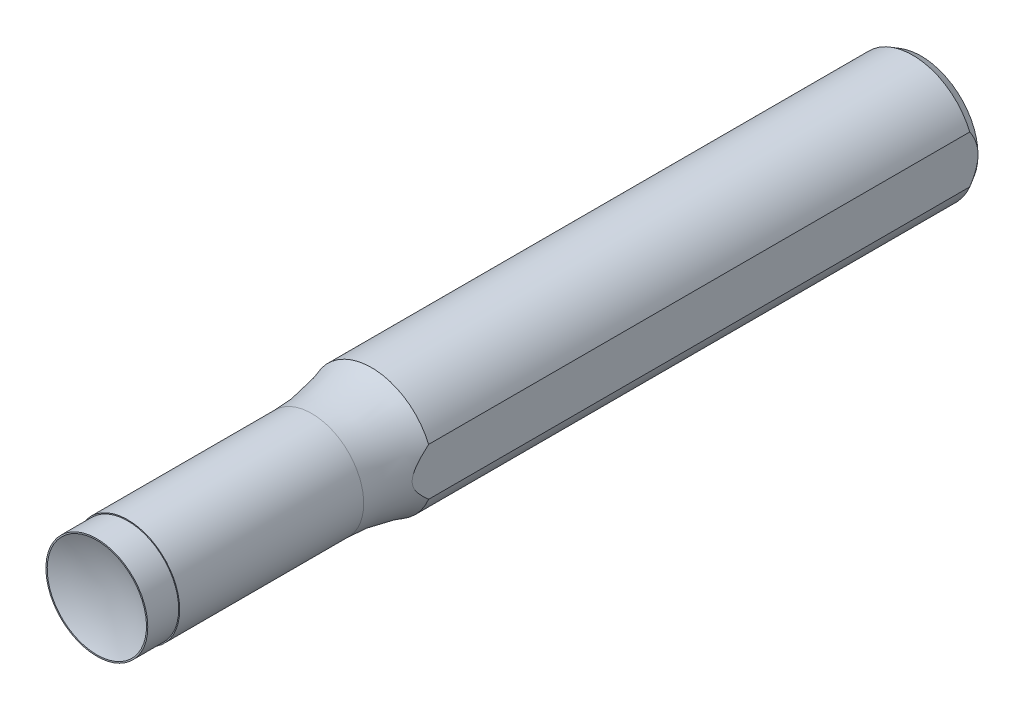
ISO-10303-21;
HEADER;
FILE_DESCRIPTION(('STEP AP214'),'2;1');
FILE_NAME('part.step','',(''),(''),'','','');
FILE_SCHEMA(('AUTOMOTIVE_DESIGN { 1 0 10303 214 1 1 1 1 }'));
ENDSEC;
DATA;
#1=APPLICATION_CONTEXT('core data for automotive mechanical design processes');
#2=APPLICATION_PROTOCOL_DEFINITION('international standard','automotive_design',2000,#1);
#3=PRODUCT_CONTEXT('',#1,'mechanical');
#4=PRODUCT('Part','Part','',(#3));
#5=PRODUCT_RELATED_PRODUCT_CATEGORY('part','',(#4));
#6=PRODUCT_DEFINITION_FORMATION('','',#4);
#7=PRODUCT_DEFINITION_CONTEXT('part definition',#1,'design');
#8=PRODUCT_DEFINITION('design','',#6,#7);
#9=PRODUCT_DEFINITION_SHAPE('','',#8);
#10=(LENGTH_UNIT() NAMED_UNIT(*) SI_UNIT(.MILLI.,.METRE.));
#11=(NAMED_UNIT(*) PLANE_ANGLE_UNIT() SI_UNIT($,.RADIAN.));
#12=(NAMED_UNIT(*) SI_UNIT($,.STERADIAN.) SOLID_ANGLE_UNIT());
#13=UNCERTAINTY_MEASURE_WITH_UNIT(LENGTH_MEASURE(1.E-05),#10,'distance_accuracy_value','');
#14=(GEOMETRIC_REPRESENTATION_CONTEXT(3) GLOBAL_UNCERTAINTY_ASSIGNED_CONTEXT((#13)) GLOBAL_UNIT_ASSIGNED_CONTEXT((#10,
#11,#12)) REPRESENTATION_CONTEXT('',''));
#15=CARTESIAN_POINT('',(0.,0.,0.));
#16=DIRECTION('',(0.,0.,1.));
#17=DIRECTION('',(1.,0.,0.));
#18=AXIS2_PLACEMENT_3D('',#15,#16,#17);
#19=CARTESIAN_POINT('',(0.,0.,-42.3333333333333));
#20=DIRECTION('',(0.,0.,1.));
#21=DIRECTION('',(1.,0.,0.));
#22=AXIS2_PLACEMENT_3D('',#19,#20,#21);
#23=CYLINDRICAL_SURFACE('',#22,8.);
#24=CARTESIAN_POINT('',(0.,0.,-33.123114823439));
#25=DIRECTION('',(0.,0.,1.));
#26=DIRECTION('',(0.,-1.,0.));
#27=AXIS2_PLACEMENT_3D('',#24,#25,#26);
#28=CIRCLE('',#27,8.);
#29=CARTESIAN_POINT('',(0.,-8.,-33.123114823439));
#30=VERTEX_POINT('',#29);
#31=EDGE_CURVE('E79',#30,#30,#28,.F.);
#32=ORIENTED_EDGE('',*,*,#31,.F.);
#33=EDGE_LOOP('',(#32));
#34=FACE_BOUND('',#33,.T.);
#35=CARTESIAN_POINT('',(0.,0.,-4.7625));
#36=DIRECTION('',(0.,0.,1.));
#37=DIRECTION('',(1.,0.,0.));
#38=AXIS2_PLACEMENT_3D('',#35,#36,#37);
#39=CIRCLE('',#38,8.);
#40=CARTESIAN_POINT('',(8.,0.,-4.7625));
#41=VERTEX_POINT('',#40);
#42=EDGE_CURVE('E90',#41,#41,#39,.F.);
#43=ORIENTED_EDGE('',*,*,#42,.T.);
#44=EDGE_LOOP('',(#43));
#45=FACE_BOUND('',#44,.T.);
#46=ADVANCED_FACE('F42',(#34,#45),#23,.T.);
#47=CARTESIAN_POINT('',(0.,0.,-4.7625));
#48=DIRECTION('',(0.,0.,1.));
#49=DIRECTION('',(1.,0.,0.));
#50=AXIS2_PLACEMENT_3D('',#47,#48,#49);
#51=PLANE('',#50);
#52=ORIENTED_EDGE('',*,*,#42,.F.);
#53=EDGE_LOOP('',(#52));
#54=FACE_BOUND('',#53,.T.);
#55=CARTESIAN_POINT('',(0.,0.,-4.7625));
#56=DIRECTION('',(0.,0.,1.));
#57=DIRECTION('',(1.,0.,0.));
#58=AXIS2_PLACEMENT_3D('',#55,#56,#57);
#59=CIRCLE('',#58,7.85);
#60=CARTESIAN_POINT('',(7.85,0.,-4.7625));
#61=VERTEX_POINT('',#60);
#62=EDGE_CURVE('E97',#61,#61,#59,.T.);
#63=ORIENTED_EDGE('',*,*,#62,.F.);
#64=EDGE_LOOP('',(#63));
#65=FACE_BOUND('',#64,.T.);
#66=ADVANCED_FACE('F110',(#54,#65),#51,.T.);
#67=CARTESIAN_POINT('',(0.,0.,-4.7625));
#68=DIRECTION('',(0.,0.,1.));
#69=DIRECTION('',(1.,0.,0.));
#70=AXIS2_PLACEMENT_3D('',#67,#68,#69);
#71=CYLINDRICAL_SURFACE('',#70,7.85);
#72=CARTESIAN_POINT('',(0.,0.,0.));
#73=DIRECTION('',(0.,0.,1.));
#74=DIRECTION('',(1.,0.,0.));
#75=AXIS2_PLACEMENT_3D('',#72,#73,#74);
#76=CIRCLE('',#75,7.85);
#77=CARTESIAN_POINT('',(7.85,0.,0.));
#78=VERTEX_POINT('',#77);
#79=EDGE_CURVE('E122',#78,#78,#76,.T.);
#80=CARTESIAN_POINT('',(7.85,0.,-4.7625));
#81=CARTESIAN_POINT('',(7.85,0.,-4.712890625));
#82=CARTESIAN_POINT('',(7.85,0.,-4.66328125));
#83=CARTESIAN_POINT('',(7.85,0.,-4.5640625));
#84=CARTESIAN_POINT('',(7.85,0.,-4.514453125));
#85=CARTESIAN_POINT('',(7.85,0.,-4.415234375));
#86=CARTESIAN_POINT('',(7.85,0.,-4.365625));
#87=CARTESIAN_POINT('',(7.85,0.,-4.26640625));
#88=CARTESIAN_POINT('',(7.85,0.,-4.216796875));
#89=CARTESIAN_POINT('',(7.85,0.,-4.117578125));
#90=CARTESIAN_POINT('',(7.85,0.,-4.06796875));
#91=CARTESIAN_POINT('',(7.85,0.,-3.96875));
#92=CARTESIAN_POINT('',(7.85,0.,-3.919140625));
#93=CARTESIAN_POINT('',(7.85,0.,-3.819921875));
#94=CARTESIAN_POINT('',(7.85,0.,-3.7703125));
#95=CARTESIAN_POINT('',(7.85,0.,-3.67109375));
#96=CARTESIAN_POINT('',(7.85,0.,-3.621484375));
#97=CARTESIAN_POINT('',(7.85,0.,-3.522265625));
#98=CARTESIAN_POINT('',(7.85,0.,-3.47265625));
#99=CARTESIAN_POINT('',(7.85,0.,-3.3734375));
#100=CARTESIAN_POINT('',(7.85,0.,-3.323828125));
#101=CARTESIAN_POINT('',(7.85,0.,-3.224609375));
#102=CARTESIAN_POINT('',(7.85,0.,-3.175));
#103=CARTESIAN_POINT('',(7.85,0.,-3.07578125));
#104=CARTESIAN_POINT('',(7.85,0.,-3.026171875));
#105=CARTESIAN_POINT('',(7.85,0.,-2.926953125));
#106=CARTESIAN_POINT('',(7.85,0.,-2.87734375));
#107=CARTESIAN_POINT('',(7.85,0.,-2.778125));
#108=CARTESIAN_POINT('',(7.85,0.,-2.728515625));
#109=CARTESIAN_POINT('',(7.85,0.,-2.629296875));
#110=CARTESIAN_POINT('',(7.85,0.,-2.5796875));
#111=CARTESIAN_POINT('',(7.85,0.,-2.48046875));
#112=CARTESIAN_POINT('',(7.85,0.,-2.430859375));
#113=CARTESIAN_POINT('',(7.85,0.,-2.331640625));
#114=CARTESIAN_POINT('',(7.85,0.,-2.28203125));
#115=CARTESIAN_POINT('',(7.85,0.,-2.1828125));
#116=CARTESIAN_POINT('',(7.85,0.,-2.133203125));
#117=CARTESIAN_POINT('',(7.85,0.,-2.033984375));
#118=CARTESIAN_POINT('',(7.85,0.,-1.984375));
#119=CARTESIAN_POINT('',(7.85,0.,-1.88515625));
#120=CARTESIAN_POINT('',(7.85,0.,-1.835546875));
#121=CARTESIAN_POINT('',(7.85,0.,-1.736328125));
#122=CARTESIAN_POINT('',(7.85,0.,-1.68671875));
#123=CARTESIAN_POINT('',(7.85,0.,-1.5875));
#124=CARTESIAN_POINT('',(7.85,0.,-1.537890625));
#125=CARTESIAN_POINT('',(7.85,0.,-1.438671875));
#126=CARTESIAN_POINT('',(7.85,0.,-1.3890625));
#127=CARTESIAN_POINT('',(7.85,0.,-1.28984375));
#128=CARTESIAN_POINT('',(7.85,0.,-1.240234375));
#129=CARTESIAN_POINT('',(7.85,0.,-1.141015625));
#130=CARTESIAN_POINT('',(7.85,0.,-1.09140625));
#131=CARTESIAN_POINT('',(7.85,0.,-0.9921875));
#132=CARTESIAN_POINT('',(7.85,0.,-0.942578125));
#133=CARTESIAN_POINT('',(7.85,0.,-0.843359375));
#134=CARTESIAN_POINT('',(7.85,0.,-0.79375));
#135=CARTESIAN_POINT('',(7.85,0.,-0.69453125));
#136=CARTESIAN_POINT('',(7.85,0.,-0.644921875));
#137=CARTESIAN_POINT('',(7.85,0.,-0.545703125));
#138=CARTESIAN_POINT('',(7.85,0.,-0.49609375));
#139=CARTESIAN_POINT('',(7.85,0.,-0.396875));
#140=CARTESIAN_POINT('',(7.85,0.,-0.347265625));
#141=CARTESIAN_POINT('',(7.85,0.,-0.248046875));
#142=CARTESIAN_POINT('',(7.85,0.,-0.1984375));
#143=CARTESIAN_POINT('',(7.85,0.,-0.09921875));
#144=CARTESIAN_POINT('',(7.85,0.,-0.049609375));
#145=CARTESIAN_POINT('',(7.85,0.,0.));
#146=B_SPLINE_CURVE_WITH_KNOTS('',3,(#80,#81,#82,#83,#84,#85,#86,#87,#88,#89,#90,#91,#92,#93,
#94,#95,#96,#97,#98,#99,#100,#101,#102,#103,#104,#105,#106,#107,#108,#109,#110,#111,#112,#113,
#114,#115,#116,#117,#118,#119,#120,#121,#122,#123,#124,#125,#126,#127,#128,#129,#130,#131,#132,
#133,#134,#135,#136,#137,#138,#139,#140,#141,#142,#143,#144,#145),.UNSPECIFIED.,.F.,.F.,(4,2,2,
2,2,2,2,2,2,2,2,2,2,2,2,2,2,2,2,2,2,2,2,2,2,2,2,2,2,2,2,2,4),(0.,0.148828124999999,
0.297656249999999,0.446484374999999,0.595312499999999,0.744140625,0.89296875,1.041796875,
1.190625,1.339453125,1.48828125,1.637109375,1.7859375,1.934765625,2.08359375,2.232421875,
2.38125,2.530078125,2.67890625,2.827734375,2.9765625,3.125390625,3.27421875,3.423046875,
3.571875,3.720703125,3.86953125,4.018359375,4.1671875,4.316015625,4.46484375,4.613671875,
4.7625),.UNSPECIFIED.);
#147=EDGE_CURVE('BSEAM116',#61,#78,#146,.T.);
#148=ORIENTED_EDGE('',*,*,#62,.T.);
#149=ORIENTED_EDGE('',*,*,#79,.F.);
#150=ORIENTED_EDGE('',*,*,#147,.T.);
#151=ORIENTED_EDGE('',*,*,#147,.F.);
#152=EDGE_LOOP('',(#148,#150,#149,#151));
#153=FACE_BOUND('',#152,.T.);
#154=ADVANCED_FACE('F116',(#153),#71,.T.);
#155=CARTESIAN_POINT('',(0.,0.,0.));
#156=DIRECTION('',(0.,0.,1.));
#157=DIRECTION('',(1.,0.,0.));
#158=AXIS2_PLACEMENT_3D('',#155,#156,#157);
#159=PLANE('',#158);
#160=CARTESIAN_POINT('',(0.,0.,0.));
#161=DIRECTION('',(0.,0.,1.));
#162=DIRECTION('',(0.,-1.,0.));
#163=AXIS2_PLACEMENT_3D('',#160,#161,#162);
#164=CIRCLE('',#163,7.65);
#165=CARTESIAN_POINT('',(0.,-7.65,0.));
#166=VERTEX_POINT('',#165);
#167=EDGE_CURVE('E126',#166,#166,#164,.T.);
#168=ORIENTED_EDGE('',*,*,#167,.F.);
#169=EDGE_LOOP('',(#168));
#170=FACE_BOUND('',#169,.T.);
#171=ORIENTED_EDGE('',*,*,#79,.T.);
#172=EDGE_LOOP('',(#171));
#173=FACE_BOUND('',#172,.T.);
#174=ADVANCED_FACE('F157',(#170,#173),#159,.T.);
#175=CARTESIAN_POINT('',(0.,0.,17.4464896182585));
#176=DIRECTION('',(0.,0.,1.));
#177=DIRECTION('',(0.,-1.,0.));
#178=AXIS2_PLACEMENT_3D('',#175,#176,#177);
#179=SPHERICAL_SURFACE('',#178,19.05);
#180=ORIENTED_EDGE('',*,*,#167,.T.);
#181=EDGE_LOOP('',(#180));
#182=FACE_BOUND('',#181,.T.);
#183=ADVANCED_FACE('F160',(#182),#179,.F.);
#184=CARTESIAN_POINT('',(0.,0.,-33.123114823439));
#185=DIRECTION('',(0.,0.,-1.));
#186=DIRECTION('',(0.,1.,0.));
#187=AXIS2_PLACEMENT_3D('',#184,#185,#186);
#188=TOROIDAL_SURFACE('',#187,36.575,28.575);
#189=CARTESIAN_POINT('',(8.79176515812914,14.7553078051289,-54.1042634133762));
#190=CARTESIAN_POINT('',(8.79176515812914,14.4706916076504,-53.8782049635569));
#191=CARTESIAN_POINT('',(8.79176515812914,14.1891182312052,-53.6483331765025));
#192=CARTESIAN_POINT('',(8.79176515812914,13.6320212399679,-53.181411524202));
#193=CARTESIAN_POINT('',(8.79176515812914,13.3564971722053,-52.944362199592));
#194=CARTESIAN_POINT('',(8.79176515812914,12.8115776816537,-52.4636389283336));
#195=CARTESIAN_POINT('',(8.79176515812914,12.5421788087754,-52.2199688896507));
#196=CARTESIAN_POINT('',(8.79176515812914,12.0092235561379,-51.7263230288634));
#197=CARTESIAN_POINT('',(8.79176515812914,11.7456672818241,-51.4763470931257));
#198=CARTESIAN_POINT('',(8.79176515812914,10.9673966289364,-50.7214050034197));
#199=CARTESIAN_POINT('',(8.79176515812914,10.4610143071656,-50.2078187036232));
#200=CARTESIAN_POINT('',(8.79176515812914,9.46861052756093,-49.161468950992));
#201=CARTESIAN_POINT('',(8.79176515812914,8.9825887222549,-48.6287058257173));
#202=CARTESIAN_POINT('',(8.79176515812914,8.26487396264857,-47.8170319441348));
#203=CARTESIAN_POINT('',(8.79176515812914,8.02689744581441,-47.5436335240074));
#204=CARTESIAN_POINT('',(8.79176515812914,7.55452558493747,-46.9937588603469));
#205=CARTESIAN_POINT('',(8.79176515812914,7.32013024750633,-46.7172826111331));
#206=CARTESIAN_POINT('',(8.79176515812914,6.85396996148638,-46.1618393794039));
#207=CARTESIAN_POINT('',(8.79176515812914,6.6222067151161,-45.8828709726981));
#208=CARTESIAN_POINT('',(8.79176515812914,6.16039479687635,-45.3235479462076));
#209=CARTESIAN_POINT('',(8.79176515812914,5.93034603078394,-45.0431934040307));
#210=CARTESIAN_POINT('',(8.79176515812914,5.47095483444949,-44.4828423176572));
#211=CARTESIAN_POINT('',(8.79176515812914,5.24161191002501,-44.2028461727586));
#212=CARTESIAN_POINT('',(8.79176515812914,4.78110760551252,-43.644227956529));
#213=CARTESIAN_POINT('',(8.79176515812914,4.54994581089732,-43.3656062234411));
#214=CARTESIAN_POINT('',(8.79176515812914,4.19973860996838,-42.950885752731));
#215=CARTESIAN_POINT('',(8.79176515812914,4.08249974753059,-42.8132658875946));
#216=CARTESIAN_POINT('',(8.79176515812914,3.84628047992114,-42.5395315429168));
#217=CARTESIAN_POINT('',(8.79176515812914,3.72730013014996,-42.4034170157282));
#218=CARTESIAN_POINT('',(8.79176515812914,3.48697683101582,-42.1333813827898));
#219=CARTESIAN_POINT('',(8.79176515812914,3.36563484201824,-41.9994594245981));
#220=CARTESIAN_POINT('',(8.79176515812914,3.11968317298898,-41.7346576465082));
#221=CARTESIAN_POINT('',(8.79176515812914,2.99507394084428,-41.6037774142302));
#222=CARTESIAN_POINT('',(8.79176515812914,2.82873759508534,-41.4349837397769));
#223=CARTESIAN_POINT('',(8.79176515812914,2.78900888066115,-41.39509815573));
#224=CARTESIAN_POINT('',(8.79176515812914,2.70907299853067,-41.3158039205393));
#225=CARTESIAN_POINT('',(8.79176515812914,2.66886579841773,-41.2763953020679));
#226=CARTESIAN_POINT('',(8.79176515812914,2.54746475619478,-41.1589751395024));
#227=CARTESIAN_POINT('',(8.79176515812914,2.46548913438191,-41.0817669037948));
#228=CARTESIAN_POINT('',(8.79176515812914,2.2986781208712,-40.9297574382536));
#229=CARTESIAN_POINT('',(8.79176515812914,2.21383197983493,-40.8549679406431));
#230=CARTESIAN_POINT('',(8.79176515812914,2.04111599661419,-40.7089499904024));
#231=CARTESIAN_POINT('',(8.79176515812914,1.9532460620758,-40.6377216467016));
#232=CARTESIAN_POINT('',(8.79176515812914,1.77252194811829,-40.4988724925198));
#233=CARTESIAN_POINT('',(8.79176515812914,1.67961271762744,-40.4313219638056));
#234=CARTESIAN_POINT('',(8.79176515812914,1.48949418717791,-40.3026306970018));
#235=CARTESIAN_POINT('',(8.79176515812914,1.39228331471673,-40.2414923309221));
#236=CARTESIAN_POINT('',(8.79176515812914,1.09437660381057,-40.0716297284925));
#237=CARTESIAN_POINT('',(8.79176515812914,0.88583647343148,-39.9751625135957));
#238=CARTESIAN_POINT('',(8.79176515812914,0.546880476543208,-39.8701156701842));
#239=CARTESIAN_POINT('',(8.79176515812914,0.422763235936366,-39.8415338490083));
#240=CARTESIAN_POINT('',(8.79176515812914,0.171362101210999,-39.8063751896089));
#241=CARTESIAN_POINT('',(8.79176515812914,0.0440802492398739,-39.7997845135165));
#242=CARTESIAN_POINT('',(8.79176515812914,-0.209572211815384,-39.8096967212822));
#243=CARTESIAN_POINT('',(8.79176515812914,-0.335942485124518,-39.8262077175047));
#244=CARTESIAN_POINT('',(8.79176515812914,-0.584210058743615,-39.8797087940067));
#245=CARTESIAN_POINT('',(8.79176515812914,-0.706103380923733,-39.9167166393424));
#246=CARTESIAN_POINT('',(8.79176515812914,-0.919554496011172,-39.9975926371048));
#247=CARTESIAN_POINT('',(8.79176515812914,-1.01225713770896,-40.0385543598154));
#248=CARTESIAN_POINT('',(8.79176515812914,-1.1937288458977,-40.1284994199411));
#249=CARTESIAN_POINT('',(8.79176515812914,-1.28249496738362,-40.177488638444));
#250=CARTESIAN_POINT('',(8.79176515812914,-1.45667079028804,-40.2818858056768));
#251=CARTESIAN_POINT('',(8.79176515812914,-1.54206334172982,-40.3373220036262));
#252=CARTESIAN_POINT('',(8.79176515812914,-1.70945249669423,-40.4529924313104));
#253=CARTESIAN_POINT('',(8.79176515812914,-1.79145043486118,-40.5132247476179));
#254=CARTESIAN_POINT('',(8.79176515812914,-2.02589230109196,-40.6939314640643));
#255=CARTESIAN_POINT('',(8.79176515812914,-2.17452229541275,-40.819336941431));
#256=CARTESIAN_POINT('',(8.79176515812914,-2.46411558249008,-41.07876714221));
#257=CARTESIAN_POINT('',(8.79176515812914,-2.60507190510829,-41.2127994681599));
#258=CARTESIAN_POINT('',(8.79176515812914,-2.88168459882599,-41.4868745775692));
#259=CARTESIAN_POINT('',(8.79176515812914,-3.01732667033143,-41.6269316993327));
#260=CARTESIAN_POINT('',(8.79176515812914,-3.28451490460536,-41.9109062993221));
#261=CARTESIAN_POINT('',(8.79176515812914,-3.41606049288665,-42.0548243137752));
#262=CARTESIAN_POINT('',(8.79176515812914,-3.67734130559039,-42.346572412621));
#263=CARTESIAN_POINT('',(8.79176515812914,-3.80705042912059,-42.4944257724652));
#264=CARTESIAN_POINT('',(8.79176515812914,-4.06436323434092,-42.7919662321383));
#265=CARTESIAN_POINT('',(8.79176515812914,-4.19196675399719,-42.9416534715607));
#266=CARTESIAN_POINT('',(8.79176515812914,-4.44554049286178,-43.241997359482));
#267=CARTESIAN_POINT('',(8.79176515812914,-4.5715129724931,-43.3926521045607));
#268=CARTESIAN_POINT('',(8.79176515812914,-4.82255527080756,-43.6947041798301));
#269=CARTESIAN_POINT('',(8.79176515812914,-4.94762511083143,-43.8461014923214));
#270=CARTESIAN_POINT('',(8.79176515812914,-5.25936331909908,-44.2246586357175));
#271=CARTESIAN_POINT('',(8.79176515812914,-5.44573875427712,-44.4520592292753));
#272=CARTESIAN_POINT('',(8.79176515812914,-5.8185335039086,-44.9068250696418));
#273=CARTESIAN_POINT('',(8.79176515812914,-6.00495281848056,-45.1341903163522));
#274=CARTESIAN_POINT('',(8.79176515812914,-6.37865861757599,-45.5882114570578));
#275=CARTESIAN_POINT('',(8.79176515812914,-6.56594510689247,-45.8148673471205));
#276=CARTESIAN_POINT('',(8.79176515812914,-6.94201956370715,-46.266929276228));
#277=CARTESIAN_POINT('',(8.79176515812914,-7.13080752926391,-46.4923353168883));
#278=CARTESIAN_POINT('',(8.79176515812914,-7.7001630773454,-47.1659316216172));
#279=CARTESIAN_POINT('',(8.79176515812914,-8.08377568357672,-47.6115655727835));
#280=CARTESIAN_POINT('',(8.79176515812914,-8.86211750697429,-48.4930705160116));
#281=CARTESIAN_POINT('',(8.79176515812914,-9.2568469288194,-48.9289413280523));
#282=CARTESIAN_POINT('',(8.79176515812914,-10.0538194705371,-49.782529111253));
#283=CARTESIAN_POINT('',(8.79176515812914,-10.455882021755,-50.2004141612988));
#284=CARTESIAN_POINT('',(8.79176515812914,-11.2739868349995,-51.022231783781));
#285=CARTESIAN_POINT('',(8.79176515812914,-11.6900279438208,-51.426165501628));
#286=CARTESIAN_POINT('',(8.79176515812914,-12.5384978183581,-52.2196285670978));
#287=CARTESIAN_POINT('',(8.79176515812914,-12.9709804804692,-52.6091004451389));
#288=CARTESIAN_POINT('',(8.79176515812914,-13.8514494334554,-53.3704068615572));
#289=CARTESIAN_POINT('',(8.79176515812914,-14.2994410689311,-53.7422352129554));
#290=CARTESIAN_POINT('',(8.79176515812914,-14.7553078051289,-54.1042634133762));
#291=B_SPLINE_CURVE_WITH_KNOTS('',3,(#189,#190,#191,#192,#193,#194,#195,#196,#197,#198,#199,
#200,#201,#202,#203,#204,#205,#206,#207,#208,#209,#210,#211,#212,#213,#214,#215,#216,#217,#218,
#219,#220,#221,#222,#223,#224,#225,#226,#227,#228,#229,#230,#231,#232,#233,#234,#235,#236,#237,
#238,#239,#240,#241,#242,#243,#244,#245,#246,#247,#248,#249,#250,#251,#252,#253,#254,#255,#256,
#257,#258,#259,#260,#261,#262,#263,#264,#265,#266,#267,#268,#269,#270,#271,#272,#273,#274,#275,
#276,#277,#278,#279,#280,#281,#282,#283,#284,#285,#286,#287,#288,#289,#290),.UNSPECIFIED.,.F.,
.F.,(4,2,2,2,2,2,2,2,2,2,2,2,2,2,2,2,2,2,2,2,2,2,2,2,2,2,2,2,2,2,2,2,2,2,2,2,2,2,2,2,2,2,2,2,2,
2,2,2,2,2,4),(0.,1.09035417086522,2.18062641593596,3.2702685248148,4.35993028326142,
6.52296539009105,8.68596356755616,9.77332692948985,10.8606922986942,11.9487248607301,
13.0366971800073,14.1225023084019,15.2085625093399,15.7509156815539,16.2932516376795,
16.8353714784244,17.3774173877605,17.5463017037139,17.7151975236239,18.0529791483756,
18.392208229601,18.7314476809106,19.0757841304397,19.4202475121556,20.1031124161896,
20.4835842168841,20.8638165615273,21.2441824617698,21.6248785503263,21.9284895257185,
22.2323239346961,22.5375437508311,22.8426424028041,23.4254477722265,24.0087739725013,
24.5935748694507,25.1784574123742,25.768484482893,26.3585567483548,26.9476974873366,
27.5368242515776,28.4188786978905,29.3009355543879,30.1829972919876,31.0650578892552,
32.8289256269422,34.592825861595,36.3322209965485,38.0714729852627,39.8170243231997,
41.5631833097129),.UNSPECIFIED.);
#292=CARTESIAN_POINT('',(8.79176515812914,3.66476334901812,-42.3333333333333));
#293=VERTEX_POINT('',#292);
#294=CARTESIAN_POINT('',(8.79176515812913,-3.66476334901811,-42.3333333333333));
#295=VERTEX_POINT('',#294);
#296=EDGE_CURVE('E58',#293,#295,#291,.T.);
#297=ORIENTED_EDGE('',*,*,#296,.F.);
#298=CARTESIAN_POINT('',(0.,0.,-42.3333333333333));
#299=DIRECTION('',(0.,0.,-1.));
#300=DIRECTION('',(0.,1.,0.));
#301=AXIS2_PLACEMENT_3D('',#298,#299,#300);
#302=CIRCLE('',#301,9.52499999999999);
#303=EDGE_CURVE('E131',#295,#293,#302,.T.);
#304=ORIENTED_EDGE('',*,*,#303,.F.);
#305=EDGE_LOOP('',(#297,#304));
#306=FACE_BOUND('',#305,.T.);
#307=ORIENTED_EDGE('',*,*,#31,.T.);
#308=EDGE_LOOP('',(#307));
#309=FACE_BOUND('',#308,.T.);
#310=ADVANCED_FACE('F106',(#306,#309),#188,.F.);
#311=CARTESIAN_POINT('',(0.,0.,-127.));
#312=DIRECTION('',(0.,0.,1.));
#313=DIRECTION('',(1.,0.,0.));
#314=AXIS2_PLACEMENT_3D('',#311,#312,#313);
#315=PLANE('',#314);
#316=CARTESIAN_POINT('',(0.,0.,-127.));
#317=DIRECTION('',(0.,0.,1.));
#318=DIRECTION('',(1.,0.,0.));
#319=AXIS2_PLACEMENT_3D('',#316,#317,#318);
#320=CIRCLE('',#319,8.79176515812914);
#321=CARTESIAN_POINT('',(8.79176515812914,0.,-127.));
#322=VERTEX_POINT('',#321);
#323=EDGE_CURVE('E85',#322,#322,#320,.F.);
#324=ORIENTED_EDGE('',*,*,#323,.T.);
#325=EDGE_LOOP('',(#324));
#326=FACE_BOUND('',#325,.T.);
#327=ADVANCED_FACE('F155',(#326),#315,.F.);
#328=CARTESIAN_POINT('',(0.,0.,-125.73));
#329=DIRECTION('',(0.,0.,1.));
#330=DIRECTION('',(1.,0.,0.));
#331=AXIS2_PLACEMENT_3D('',#328,#329,#330);
#332=CONICAL_SURFACE('',#331,9.525,0.523598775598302);
#333=CARTESIAN_POINT('',(8.79176515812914,-10.6627291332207,-118.291059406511));
#334=CARTESIAN_POINT('',(8.79176515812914,-10.4736349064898,-118.543726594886));
#335=CARTESIAN_POINT('',(8.79176515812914,-10.2832608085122,-118.795444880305));
#336=CARTESIAN_POINT('',(8.79176515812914,-9.89950978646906,-119.296621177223));
#337=CARTESIAN_POINT('',(8.79176515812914,-9.70613255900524,-119.546078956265));
#338=CARTESIAN_POINT('',(8.79176515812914,-9.31543210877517,-120.043004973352));
#339=CARTESIAN_POINT('',(8.79176515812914,-9.11809946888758,-120.290465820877));
#340=CARTESIAN_POINT('',(8.79176515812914,-8.71947539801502,-120.782169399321));
#341=CARTESIAN_POINT('',(8.79176515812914,-8.51818410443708,-121.02641224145));
#342=CARTESIAN_POINT('',(8.79176515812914,-8.10883988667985,-121.513581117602));
#343=CARTESIAN_POINT('',(8.79176515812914,-7.90073806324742,-121.75646615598));
#344=CARTESIAN_POINT('',(8.79176515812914,-7.47900201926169,-122.237381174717));
#345=CARTESIAN_POINT('',(8.79176515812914,-7.26536803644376,-122.475411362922));
#346=CARTESIAN_POINT('',(8.79176515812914,-6.83176075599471,-122.945188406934));
#347=CARTESIAN_POINT('',(8.79176515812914,-6.61179425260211,-123.176941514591));
#348=CARTESIAN_POINT('',(8.79176515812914,-6.16407664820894,-123.632773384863));
#349=CARTESIAN_POINT('',(8.79176515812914,-5.93632693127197,-123.8568534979));
#350=CARTESIAN_POINT('',(8.79176515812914,-5.54045643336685,-124.230031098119));
#351=CARTESIAN_POINT('',(8.79176515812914,-5.37470587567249,-124.381639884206));
#352=CARTESIAN_POINT('',(8.79176515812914,-5.03789628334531,-124.678893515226));
#353=CARTESIAN_POINT('',(8.79176515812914,-4.86683687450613,-124.82453793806));
#354=CARTESIAN_POINT('',(8.79176515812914,-4.51838676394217,-125.108734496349));
#355=CARTESIAN_POINT('',(8.79176515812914,-4.34098532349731,-125.247273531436));
#356=CARTESIAN_POINT('',(8.79176515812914,-3.97934788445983,-125.515187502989));
#357=CARTESIAN_POINT('',(8.79176515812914,-3.7951118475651,-125.644562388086));
#358=CARTESIAN_POINT('',(8.79176515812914,-3.4160021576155,-125.8938050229));
#359=CARTESIAN_POINT('',(8.79176515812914,-3.22100525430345,-126.013486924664));
#360=CARTESIAN_POINT('',(8.79176515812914,-2.82243264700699,-126.23787253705));
#361=CARTESIAN_POINT('',(8.79176515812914,-2.61885540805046,-126.34257355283));
#362=CARTESIAN_POINT('',(8.79176515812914,-2.20394674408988,-126.532622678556));
#363=CARTESIAN_POINT('',(8.79176515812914,-1.99265771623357,-126.618062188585));
#364=CARTESIAN_POINT('',(8.79176515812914,-1.56214573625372,-126.765790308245));
#365=CARTESIAN_POINT('',(8.79176515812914,-1.34292980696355,-126.828098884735));
#366=CARTESIAN_POINT('',(8.79176515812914,-0.975279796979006,-126.908636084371));
#367=CARTESIAN_POINT('',(8.79176515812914,-0.828532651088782,-126.9346562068));
#368=CARTESIAN_POINT('',(8.79176515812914,-0.533370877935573,-126.974128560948));
#369=CARTESIAN_POINT('',(8.79176515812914,-0.384956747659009,-126.987584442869));
#370=CARTESIAN_POINT('',(8.79176515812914,-0.0875373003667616,-127.001421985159));
#371=CARTESIAN_POINT('',(8.79176515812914,0.0614679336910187,-127.00180541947));
#372=CARTESIAN_POINT('',(8.79176515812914,0.358938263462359,-126.989490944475));
#373=CARTESIAN_POINT('',(8.79176515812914,0.507403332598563,-126.976792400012));
#374=CARTESIAN_POINT('',(8.79176515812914,0.802087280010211,-126.938868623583));
#375=CARTESIAN_POINT('',(8.79176515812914,0.948312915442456,-126.913695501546));
#376=CARTESIAN_POINT('',(8.79176515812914,1.23830007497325,-126.851720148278));
#377=CARTESIAN_POINT('',(8.79176515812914,1.38206055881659,-126.814913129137));
#378=CARTESIAN_POINT('',(8.79176515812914,1.80870609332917,-126.688658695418));
#379=CARTESIAN_POINT('',(8.79176515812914,2.08697532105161,-126.583375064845));
#380=CARTESIAN_POINT('',(8.79176515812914,2.60337361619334,-126.351752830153));
#381=CARTESIAN_POINT('',(8.79176515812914,2.84283329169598,-126.228267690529));
#382=CARTESIAN_POINT('',(8.79176515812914,3.31023059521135,-125.960874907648));
#383=CARTESIAN_POINT('',(8.79176515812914,3.53815770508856,-125.816949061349));
#384=CARTESIAN_POINT('',(8.79176515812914,3.98547376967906,-125.512244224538));
#385=CARTESIAN_POINT('',(8.79176515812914,4.20476189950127,-125.351319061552));
#386=CARTESIAN_POINT('',(8.79176515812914,4.63383214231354,-125.017538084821));
#387=CARTESIAN_POINT('',(8.79176515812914,4.84361821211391,-124.844687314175));
#388=CARTESIAN_POINT('',(8.79176515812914,5.32521022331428,-124.429271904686));
#389=CARTESIAN_POINT('',(8.79176515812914,5.59381264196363,-124.183009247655));
#390=CARTESIAN_POINT('',(8.79176515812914,6.11939033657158,-123.678310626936));
#391=CARTESIAN_POINT('',(8.79176515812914,6.37636135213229,-123.419870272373));
#392=CARTESIAN_POINT('',(8.79176515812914,6.88131611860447,-122.893337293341));
#393=CARTESIAN_POINT('',(8.79176515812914,7.12927952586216,-122.625225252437));
#394=CARTESIAN_POINT('',(8.79176515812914,7.61732781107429,-122.082023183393));
#395=CARTESIAN_POINT('',(8.79176515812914,7.85741379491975,-121.806934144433));
#396=CARTESIAN_POINT('',(8.79176515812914,8.31828668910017,-121.266255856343));
#397=CARTESIAN_POINT('',(8.79176515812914,8.53941529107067,-121.000956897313));
#398=CARTESIAN_POINT('',(8.79176515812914,8.97677143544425,-120.466333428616));
#399=CARTESIAN_POINT('',(8.79176515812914,9.192998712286,-120.197008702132));
#400=CARTESIAN_POINT('',(8.79176515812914,9.62018291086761,-119.656440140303));
#401=CARTESIAN_POINT('',(8.79176515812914,9.83116104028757,-119.385213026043));
#402=CARTESIAN_POINT('',(8.79176515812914,10.2495056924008,-118.840049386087));
#403=CARTESIAN_POINT('',(8.79176515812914,10.4568727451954,-118.566113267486));
#404=CARTESIAN_POINT('',(8.79176515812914,10.6627291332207,-118.291059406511));
#405=B_SPLINE_CURVE_WITH_KNOTS('',3,(#333,#334,#335,#336,#337,#338,#339,#340,#341,#342,#343,
#344,#345,#346,#347,#348,#349,#350,#351,#352,#353,#354,#355,#356,#357,#358,#359,#360,#361,#362,
#363,#364,#365,#366,#367,#368,#369,#370,#371,#372,#373,#374,#375,#376,#377,#378,#379,#380,#381,
#382,#383,#384,#385,#386,#387,#388,#389,#390,#391,#392,#393,#394,#395,#396,#397,#398,#399,#400,
#401,#402,#403,#404),.UNSPECIFIED.,.F.,.F.,(4,2,2,2,2,2,2,2,2,2,2,2,2,2,2,2,2,2,2,2,2,2,2,2,2,2,
2,2,2,2,2,2,2,2,2,4),(0.,0.946777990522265,1.89365226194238,2.84313965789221,3.79259415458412,
4.75205342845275,5.71147153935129,6.66989605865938,7.6281510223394,8.30192536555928,
8.97574730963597,9.65076995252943,10.325796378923,11.0116535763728,11.697633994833,
12.3802873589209,13.0623500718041,13.508978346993,13.9554768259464,14.4019147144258,
14.8483742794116,15.2929843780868,15.7377776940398,16.6273040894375,17.4344385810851,
18.2422964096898,19.0577749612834,19.8729107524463,20.9655865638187,22.0586594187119,
23.1540643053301,24.2493147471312,25.2853610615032,26.3214633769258,27.3522974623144,
28.3829789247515),.UNSPECIFIED.);
#406=CARTESIAN_POINT('',(8.79176515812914,-3.66476334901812,-125.73));
#407=VERTEX_POINT('',#406);
#408=EDGE_CURVE('E73',#407,#322,#405,.T.);
#409=ORIENTED_EDGE('',*,*,#408,.F.);
#410=CARTESIAN_POINT('',(0.,0.,-125.73));
#411=DIRECTION('',(0.,0.,1.));
#412=DIRECTION('',(1.,0.,0.));
#413=AXIS2_PLACEMENT_3D('',#410,#411,#412);
#414=CIRCLE('',#413,9.525);
#415=CARTESIAN_POINT('',(8.79176515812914,3.66476334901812,-125.73));
#416=VERTEX_POINT('',#415);
#417=EDGE_CURVE('E83',#416,#407,#414,.T.);
#418=ORIENTED_EDGE('',*,*,#417,.F.);
#419=EDGE_CURVE('E64',#322,#416,#405,.T.);
#420=ORIENTED_EDGE('',*,*,#419,.F.);
#421=ORIENTED_EDGE('',*,*,#323,.F.);
#422=EDGE_LOOP('',(#409,#418,#420,#421));
#423=FACE_BOUND('',#422,.T.);
#424=ADVANCED_FACE('F44',(#423),#332,.T.);
#425=CARTESIAN_POINT('',(0.,0.,-127.));
#426=DIRECTION('',(0.,0.,1.));
#427=DIRECTION('',(1.,0.,0.));
#428=AXIS2_PLACEMENT_3D('',#425,#426,#427);
#429=CYLINDRICAL_SURFACE('',#428,9.525);
#430=DIRECTION('',(0.,0.,1.));
#431=VECTOR('',#430,1.);
#432=CARTESIAN_POINT('',(8.79176515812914,3.66476334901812,-127.));
#433=LINE('',#432,#431);
#434=EDGE_CURVE('E13',#416,#293,#433,.T.);
#435=ORIENTED_EDGE('',*,*,#434,.F.);
#436=ORIENTED_EDGE('',*,*,#417,.T.);
#437=DIRECTION('',(0.,0.,1.));
#438=VECTOR('',#437,1.);
#439=CARTESIAN_POINT('',(8.79176515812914,-3.66476334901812,-127.));
#440=LINE('',#439,#438);
#441=EDGE_CURVE('E52',#295,#407,#440,.F.);
#442=ORIENTED_EDGE('',*,*,#441,.F.);
#443=ORIENTED_EDGE('',*,*,#303,.T.);
#444=EDGE_LOOP('',(#435,#436,#442,#443));
#445=FACE_BOUND('',#444,.T.);
#446=ADVANCED_FACE('F88',(#445),#429,.T.);
#447=CARTESIAN_POINT('',(8.79176515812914,3.66476334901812,0.));
#448=DIRECTION('',(-1.,0.,0.));
#449=DIRECTION('',(0.,0.,1.));
#450=AXIS2_PLACEMENT_3D('',#447,#448,#449);
#451=PLANE('',#450);
#452=ORIENTED_EDGE('',*,*,#296,.T.);
#453=ORIENTED_EDGE('',*,*,#441,.T.);
#454=ORIENTED_EDGE('',*,*,#408,.T.);
#455=ORIENTED_EDGE('',*,*,#419,.T.);
#456=ORIENTED_EDGE('',*,*,#434,.T.);
#457=EDGE_LOOP('',(#452,#453,#454,#455,#456));
#458=FACE_BOUND('',#457,.T.);
#459=ADVANCED_FACE('F72',(#458),#451,.F.);
#460=CLOSED_SHELL('',(#46,#66,#154,#174,#183,#310,#327,#424,#446,#459));
#461=MANIFOLD_SOLID_BREP('B2',#460);
#462=ADVANCED_BREP_SHAPE_REPRESENTATION('',(#18,#461),#14);
#463=SHAPE_DEFINITION_REPRESENTATION(#9,#462);
ENDSEC;
END-ISO-10303-21;
